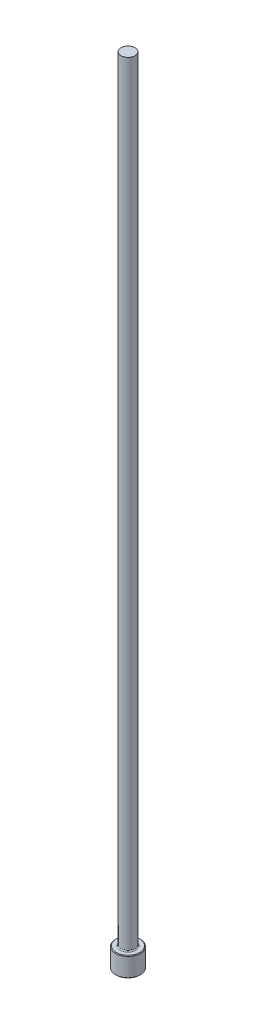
from build123d import *

# Parameters (mm, degrees)
CHAMFER1_SIZE = 0.0508
FILLET1_R     = 0.0762


with BuildPart() as part:
    # Sketch1 → Revolve1 (revolve)
    with BuildSketch(Plane.XY, mode=Mode.PRIVATE) as revolve1_sk:
        Polygon((0, 0), (-0.9906, 0), (-0.9906, 1.5748), (-0.5588, 1.5748), (-0.5588, 63.5), (0, 63.5), align=None)
    revolve(revolve1_sk.sketch.rotate(Axis((0, 259.958771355, 0), (0, -1, 0)), 270), axis=Axis((0, 259.958771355, 0), (0, -1, 0)))

    # Chamfer1
    chamfer1_edges = [part.edges().sort_by_distance(p)[0] for p in [
        (0, 1.5748, -0.9906),
        (0, 0, -0.9906),
    ]]
    chamfer(chamfer1_edges, length=CHAMFER1_SIZE)

    # Fillet1
    fillet1_edges = [part.edges().sort_by_distance(p)[0] for p in [
        (0, 1.5748, -0.5588),
    ]]
    fillet(fillet1_edges, radius=FILLET1_R)


solid = part.part
